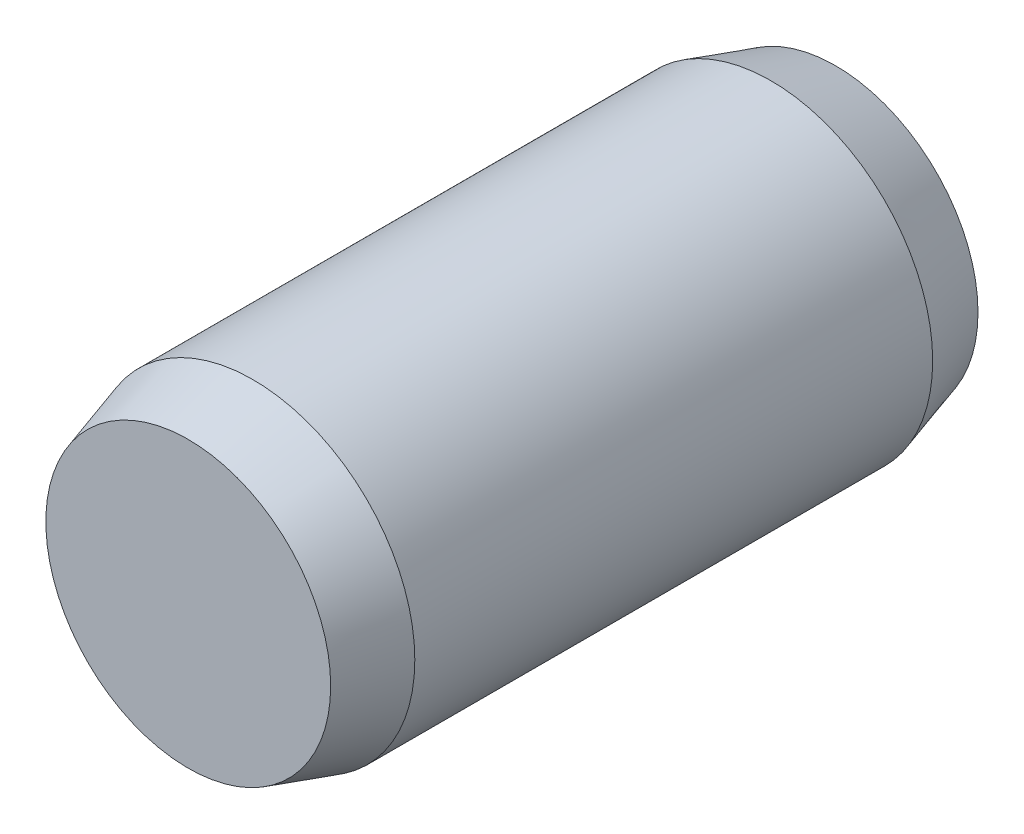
ISO-10303-21;
HEADER;
FILE_DESCRIPTION(('STEP AP214'),'2;1');
FILE_NAME('part.step','',(''),(''),'','','');
FILE_SCHEMA(('AUTOMOTIVE_DESIGN { 1 0 10303 214 1 1 1 1 }'));
ENDSEC;
DATA;
#1=APPLICATION_CONTEXT('core data for automotive mechanical design processes');
#2=APPLICATION_PROTOCOL_DEFINITION('international standard','automotive_design',2000,#1);
#3=PRODUCT_CONTEXT('',#1,'mechanical');
#4=PRODUCT('Part','Part','',(#3));
#5=PRODUCT_RELATED_PRODUCT_CATEGORY('part','',(#4));
#6=PRODUCT_DEFINITION_FORMATION('','',#4);
#7=PRODUCT_DEFINITION_CONTEXT('part definition',#1,'design');
#8=PRODUCT_DEFINITION('design','',#6,#7);
#9=PRODUCT_DEFINITION_SHAPE('','',#8);
#10=(LENGTH_UNIT() NAMED_UNIT(*) SI_UNIT(.MILLI.,.METRE.));
#11=(NAMED_UNIT(*) PLANE_ANGLE_UNIT() SI_UNIT($,.RADIAN.));
#12=(NAMED_UNIT(*) SI_UNIT($,.STERADIAN.) SOLID_ANGLE_UNIT());
#13=UNCERTAINTY_MEASURE_WITH_UNIT(LENGTH_MEASURE(1.E-05),#10,'distance_accuracy_value','');
#14=(GEOMETRIC_REPRESENTATION_CONTEXT(3) GLOBAL_UNCERTAINTY_ASSIGNED_CONTEXT((#13)) GLOBAL_UNIT_ASSIGNED_CONTEXT((#10,
#11,#12)) REPRESENTATION_CONTEXT('',''));
#15=CARTESIAN_POINT('',(0.,0.,0.));
#16=DIRECTION('',(0.,0.,1.));
#17=DIRECTION('',(1.,0.,0.));
#18=AXIS2_PLACEMENT_3D('',#15,#16,#17);
#19=CARTESIAN_POINT('',(0.,0.,10.));
#20=DIRECTION('',(0.,0.,-1.));
#21=DIRECTION('',(-1.,0.,0.));
#22=AXIS2_PLACEMENT_3D('',#19,#20,#21);
#23=CYLINDRICAL_SURFACE('',#22,2.5);
#24=CARTESIAN_POINT('',(0.,0.,1.00000000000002));
#25=DIRECTION('',(0.,0.,1.));
#26=DIRECTION('',(1.,0.,0.));
#27=AXIS2_PLACEMENT_3D('',#24,#25,#26);
#28=CIRCLE('',#27,2.5);
#29=CARTESIAN_POINT('',(2.5,0.,1.00000000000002));
#30=VERTEX_POINT('',#29);
#31=EDGE_CURVE('E47',#30,#30,#28,.T.);
#32=ORIENTED_EDGE('',*,*,#31,.T.);
#33=EDGE_LOOP('',(#32));
#34=FACE_BOUND('',#33,.T.);
#35=CARTESIAN_POINT('',(0.,0.,8.99999999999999));
#36=DIRECTION('',(0.,0.,1.));
#37=DIRECTION('',(1.,0.,0.));
#38=AXIS2_PLACEMENT_3D('',#35,#36,#37);
#39=CIRCLE('',#38,2.5);
#40=CARTESIAN_POINT('',(2.5,0.,8.99999999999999));
#41=VERTEX_POINT('',#40);
#42=EDGE_CURVE('E51',#41,#41,#39,.F.);
#43=ORIENTED_EDGE('',*,*,#42,.T.);
#44=EDGE_LOOP('',(#43));
#45=FACE_BOUND('',#44,.T.);
#46=ADVANCED_FACE('F39',(#34,#45),#23,.T.);
#47=CARTESIAN_POINT('',(0.,0.,10.));
#48=DIRECTION('',(0.,0.,1.));
#49=DIRECTION('',(1.,0.,0.));
#50=AXIS2_PLACEMENT_3D('',#47,#48,#49);
#51=PLANE('',#50);
#52=CARTESIAN_POINT('',(0.,0.,10.));
#53=DIRECTION('',(0.,0.,1.));
#54=DIRECTION('',(1.,0.,0.));
#55=AXIS2_PLACEMENT_3D('',#52,#53,#54);
#56=CIRCLE('',#55,2.2);
#57=CARTESIAN_POINT('',(2.2,0.,10.));
#58=VERTEX_POINT('',#57);
#59=EDGE_CURVE('E55',#58,#58,#56,.T.);
#60=ORIENTED_EDGE('',*,*,#59,.T.);
#61=EDGE_LOOP('',(#60));
#62=FACE_BOUND('',#61,.T.);
#63=ADVANCED_FACE('F61',(#62),#51,.T.);
#64=CARTESIAN_POINT('',(0.,0.,0.));
#65=DIRECTION('',(0.,0.,1.));
#66=DIRECTION('',(1.,0.,0.));
#67=AXIS2_PLACEMENT_3D('',#64,#65,#66);
#68=PLANE('',#67);
#69=CARTESIAN_POINT('',(0.,0.,0.));
#70=DIRECTION('',(0.,0.,1.));
#71=DIRECTION('',(1.,0.,0.));
#72=AXIS2_PLACEMENT_3D('',#69,#70,#71);
#73=CIRCLE('',#72,2.2);
#74=CARTESIAN_POINT('',(2.2,0.,0.));
#75=VERTEX_POINT('',#74);
#76=EDGE_CURVE('E10',#75,#75,#73,.F.);
#77=ORIENTED_EDGE('',*,*,#76,.T.);
#78=EDGE_LOOP('',(#77));
#79=FACE_BOUND('',#78,.T.);
#80=ADVANCED_FACE('F65',(#79),#68,.F.);
#81=CARTESIAN_POINT('',(0.,0.,10.));
#82=DIRECTION('',(0.,0.,-1.));
#83=DIRECTION('',(-1.,0.,0.));
#84=AXIS2_PLACEMENT_3D('',#81,#82,#83);
#85=CONICAL_SURFACE('',#84,2.2,0.291456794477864);
#86=ORIENTED_EDGE('',*,*,#42,.F.);
#87=EDGE_LOOP('',(#86));
#88=FACE_BOUND('',#87,.T.);
#89=ORIENTED_EDGE('',*,*,#59,.F.);
#90=EDGE_LOOP('',(#89));
#91=FACE_BOUND('',#90,.T.);
#92=ADVANCED_FACE('F63',(#88,#91),#85,.T.);
#93=CARTESIAN_POINT('',(0.,0.,1.00000000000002));
#94=DIRECTION('',(0.,0.,1.));
#95=DIRECTION('',(1.,0.,0.));
#96=AXIS2_PLACEMENT_3D('',#93,#94,#95);
#97=CONICAL_SURFACE('',#96,2.5,0.291456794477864);
#98=ORIENTED_EDGE('',*,*,#76,.F.);
#99=EDGE_LOOP('',(#98));
#100=FACE_BOUND('',#99,.T.);
#101=ORIENTED_EDGE('',*,*,#31,.F.);
#102=EDGE_LOOP('',(#101));
#103=FACE_BOUND('',#102,.T.);
#104=ADVANCED_FACE('F42',(#100,#103),#97,.T.);
#105=CLOSED_SHELL('',(#46,#63,#80,#92,#104));
#106=MANIFOLD_SOLID_BREP('B2',#105);
#107=ADVANCED_BREP_SHAPE_REPRESENTATION('',(#18,#106),#14);
#108=SHAPE_DEFINITION_REPRESENTATION(#9,#107);
ENDSEC;
END-ISO-10303-21;
